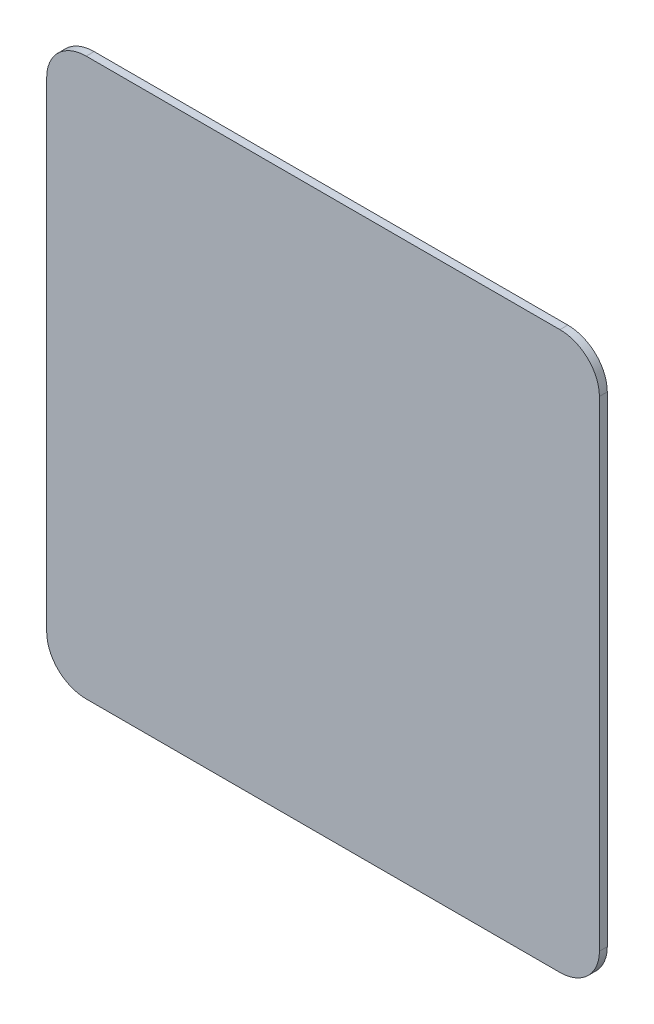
ISO-10303-21;
HEADER;
FILE_DESCRIPTION(('STEP AP214'),'2;1');
FILE_NAME('part.step','',(''),(''),'','','');
FILE_SCHEMA(('AUTOMOTIVE_DESIGN { 1 0 10303 214 1 1 1 1 }'));
ENDSEC;
DATA;
#1=APPLICATION_CONTEXT('core data for automotive mechanical design processes');
#2=APPLICATION_PROTOCOL_DEFINITION('international standard','automotive_design',2000,#1);
#3=PRODUCT_CONTEXT('',#1,'mechanical');
#4=PRODUCT('Part','Part','',(#3));
#5=PRODUCT_RELATED_PRODUCT_CATEGORY('part','',(#4));
#6=PRODUCT_DEFINITION_FORMATION('','',#4);
#7=PRODUCT_DEFINITION_CONTEXT('part definition',#1,'design');
#8=PRODUCT_DEFINITION('design','',#6,#7);
#9=PRODUCT_DEFINITION_SHAPE('','',#8);
#10=(LENGTH_UNIT() NAMED_UNIT(*) SI_UNIT(.MILLI.,.METRE.));
#11=(NAMED_UNIT(*) PLANE_ANGLE_UNIT() SI_UNIT($,.RADIAN.));
#12=(NAMED_UNIT(*) SI_UNIT($,.STERADIAN.) SOLID_ANGLE_UNIT());
#13=UNCERTAINTY_MEASURE_WITH_UNIT(LENGTH_MEASURE(1.E-05),#10,'distance_accuracy_value','');
#14=(GEOMETRIC_REPRESENTATION_CONTEXT(3) GLOBAL_UNCERTAINTY_ASSIGNED_CONTEXT((#13)) GLOBAL_UNIT_ASSIGNED_CONTEXT((#10,
#11,#12)) REPRESENTATION_CONTEXT('',''));
#15=CARTESIAN_POINT('',(0.,0.,0.));
#16=DIRECTION('',(0.,0.,1.));
#17=DIRECTION('',(1.,0.,0.));
#18=AXIS2_PLACEMENT_3D('',#15,#16,#17);
#19=CARTESIAN_POINT('',(300.,321.343713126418,-10.));
#20=DIRECTION('',(0.,0.,1.));
#21=DIRECTION('',(1.,0.,0.));
#22=AXIS2_PLACEMENT_3D('',#19,#20,#21);
#23=ELLIPSE('',#22,50.,48.2962913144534);
#24=DIRECTION('',(0.,0.,1.));
#25=VECTOR('',#24,1.);
#26=SURFACE_OF_LINEAR_EXTRUSION('',#23,#25);
#27=CARTESIAN_POINT('',(300.,321.343713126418,0.));
#28=DIRECTION('',(0.,0.,1.));
#29=DIRECTION('',(1.,0.,0.));
#30=AXIS2_PLACEMENT_3D('',#27,#28,#29);
#31=ELLIPSE('',#30,50.,48.2962913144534);
#32=CARTESIAN_POINT('',(350.,321.343713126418,0.));
#33=VERTEX_POINT('',#32);
#34=CARTESIAN_POINT('',(300.,369.640004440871,0.));
#35=VERTEX_POINT('',#34);
#36=EDGE_CURVE('E192',#33,#35,#31,.T.);
#37=ORIENTED_EDGE('',*,*,#36,.F.);
#38=DIRECTION('',(0.,0.,1.));
#39=VECTOR('',#38,1.);
#40=CARTESIAN_POINT('',(350.,321.343713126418,-10.));
#41=LINE('',#40,#39);
#42=CARTESIAN_POINT('',(350.,321.343713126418,-10.));
#43=VERTEX_POINT('',#42);
#44=EDGE_CURVE('E11',#43,#33,#41,.T.);
#45=ORIENTED_EDGE('',*,*,#44,.F.);
#46=CARTESIAN_POINT('',(300.,369.640004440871,-10.));
#47=VERTEX_POINT('',#46);
#48=EDGE_CURVE('E180',#43,#47,#23,.T.);
#49=ORIENTED_EDGE('',*,*,#48,.T.);
#50=DIRECTION('',(0.,0.,1.));
#51=VECTOR('',#50,1.);
#52=CARTESIAN_POINT('',(300.,369.640004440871,-10.));
#53=LINE('',#52,#51);
#54=EDGE_CURVE('E38',#47,#35,#53,.T.);
#55=ORIENTED_EDGE('',*,*,#54,.T.);
#56=EDGE_LOOP('',(#37,#45,#49,#55));
#57=FACE_BOUND('',#56,.T.);
#58=ADVANCED_FACE('F34',(#57),#26,.T.);
#59=CARTESIAN_POINT('',(350.,-287.189557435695,-10.));
#60=DIRECTION('',(1.,0.,0.));
#61=DIRECTION('',(0.,0.,-1.));
#62=AXIS2_PLACEMENT_3D('',#59,#60,#61);
#63=PLANE('',#62);
#64=DIRECTION('',(0.,1.,0.));
#65=VECTOR('',#64,1.);
#66=CARTESIAN_POINT('',(350.,-287.189557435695,0.));
#67=LINE('',#66,#65);
#68=CARTESIAN_POINT('',(350.,-287.189557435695,0.));
#69=VERTEX_POINT('',#68);
#70=EDGE_CURVE('E177',#69,#33,#67,.T.);
#71=ORIENTED_EDGE('',*,*,#70,.F.);
#72=DIRECTION('',(0.,0.,1.));
#73=VECTOR('',#72,1.);
#74=CARTESIAN_POINT('',(350.,-287.189557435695,-10.));
#75=LINE('',#74,#73);
#76=CARTESIAN_POINT('',(350.,-287.189557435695,-10.));
#77=VERTEX_POINT('',#76);
#78=EDGE_CURVE('E44',#77,#69,#75,.T.);
#79=ORIENTED_EDGE('',*,*,#78,.F.);
#80=DIRECTION('',(0.,1.,0.));
#81=VECTOR('',#80,1.);
#82=CARTESIAN_POINT('',(350.,-287.189557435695,-10.));
#83=LINE('',#82,#81);
#84=EDGE_CURVE('E122',#77,#43,#83,.T.);
#85=ORIENTED_EDGE('',*,*,#84,.T.);
#86=ORIENTED_EDGE('',*,*,#44,.T.);
#87=EDGE_LOOP('',(#71,#79,#85,#86));
#88=FACE_BOUND('',#87,.T.);
#89=ADVANCED_FACE('F138',(#88),#63,.T.);
#90=CARTESIAN_POINT('',(300.,-287.189557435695,-10.));
#91=DIRECTION('',(0.,0.,1.));
#92=DIRECTION('',(1.,0.,0.));
#93=AXIS2_PLACEMENT_3D('',#90,#91,#92);
#94=ELLIPSE('',#93,50.,48.2962913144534);
#95=DIRECTION('',(0.,0.,1.));
#96=VECTOR('',#95,1.);
#97=SURFACE_OF_LINEAR_EXTRUSION('',#94,#96);
#98=CARTESIAN_POINT('',(300.,-287.189557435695,0.));
#99=DIRECTION('',(0.,0.,1.));
#100=DIRECTION('',(1.,0.,0.));
#101=AXIS2_PLACEMENT_3D('',#98,#99,#100);
#102=ELLIPSE('',#101,50.,48.2962913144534);
#103=CARTESIAN_POINT('',(300.,-335.485848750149,0.));
#104=VERTEX_POINT('',#103);
#105=EDGE_CURVE('E109',#104,#69,#102,.T.);
#106=ORIENTED_EDGE('',*,*,#105,.F.);
#107=DIRECTION('',(0.,0.,1.));
#108=VECTOR('',#107,1.);
#109=CARTESIAN_POINT('',(300.,-335.485848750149,-10.));
#110=LINE('',#109,#108);
#111=CARTESIAN_POINT('',(300.,-335.485848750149,-10.));
#112=VERTEX_POINT('',#111);
#113=EDGE_CURVE('E104',#112,#104,#110,.T.);
#114=ORIENTED_EDGE('',*,*,#113,.F.);
#115=EDGE_CURVE('E107',#112,#77,#94,.T.);
#116=ORIENTED_EDGE('',*,*,#115,.T.);
#117=ORIENTED_EDGE('',*,*,#78,.T.);
#118=EDGE_LOOP('',(#106,#114,#116,#117));
#119=FACE_BOUND('',#118,.T.);
#120=ADVANCED_FACE('F106',(#119),#97,.T.);
#121=CARTESIAN_POINT('',(-300.,-335.485848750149,-10.));
#122=DIRECTION('',(0.,-1.,0.));
#123=DIRECTION('',(1.,0.,0.));
#124=AXIS2_PLACEMENT_3D('',#121,#122,#123);
#125=PLANE('',#124);
#126=DIRECTION('',(1.,0.,0.));
#127=VECTOR('',#126,1.);
#128=CARTESIAN_POINT('',(-300.,-335.485848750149,0.));
#129=LINE('',#128,#127);
#130=CARTESIAN_POINT('',(-300.,-335.485848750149,0.));
#131=VERTEX_POINT('',#130);
#132=EDGE_CURVE('E182',#131,#104,#129,.T.);
#133=ORIENTED_EDGE('',*,*,#132,.F.);
#134=DIRECTION('',(0.,0.,1.));
#135=VECTOR('',#134,1.);
#136=CARTESIAN_POINT('',(-300.,-335.485848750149,-10.));
#137=LINE('',#136,#135);
#138=CARTESIAN_POINT('',(-300.,-335.485848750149,-10.));
#139=VERTEX_POINT('',#138);
#140=EDGE_CURVE('E114',#139,#131,#137,.T.);
#141=ORIENTED_EDGE('',*,*,#140,.F.);
#142=DIRECTION('',(1.,0.,0.));
#143=VECTOR('',#142,1.);
#144=CARTESIAN_POINT('',(-300.,-335.485848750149,-10.));
#145=LINE('',#144,#143);
#146=EDGE_CURVE('E120',#139,#112,#145,.T.);
#147=ORIENTED_EDGE('',*,*,#146,.T.);
#148=ORIENTED_EDGE('',*,*,#113,.T.);
#149=EDGE_LOOP('',(#133,#141,#147,#148));
#150=FACE_BOUND('',#149,.T.);
#151=ADVANCED_FACE('F124',(#150),#125,.T.);
#152=CARTESIAN_POINT('',(-300.,-287.189557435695,-10.));
#153=DIRECTION('',(0.,0.,1.));
#154=DIRECTION('',(1.,0.,0.));
#155=AXIS2_PLACEMENT_3D('',#152,#153,#154);
#156=ELLIPSE('',#155,50.,48.2962913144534);
#157=DIRECTION('',(0.,0.,1.));
#158=VECTOR('',#157,1.);
#159=SURFACE_OF_LINEAR_EXTRUSION('',#156,#158);
#160=CARTESIAN_POINT('',(-300.,-287.189557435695,0.));
#161=DIRECTION('',(0.,0.,1.));
#162=DIRECTION('',(1.,0.,0.));
#163=AXIS2_PLACEMENT_3D('',#160,#161,#162);
#164=ELLIPSE('',#163,50.,48.2962913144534);
#165=CARTESIAN_POINT('',(-350.,-287.189557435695,0.));
#166=VERTEX_POINT('',#165);
#167=EDGE_CURVE('E184',#166,#131,#164,.T.);
#168=ORIENTED_EDGE('',*,*,#167,.F.);
#169=DIRECTION('',(0.,0.,1.));
#170=VECTOR('',#169,1.);
#171=CARTESIAN_POINT('',(-350.,-287.189557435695,-10.));
#172=LINE('',#171,#170);
#173=CARTESIAN_POINT('',(-350.,-287.189557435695,-10.));
#174=VERTEX_POINT('',#173);
#175=EDGE_CURVE('E163',#174,#166,#172,.T.);
#176=ORIENTED_EDGE('',*,*,#175,.F.);
#177=EDGE_CURVE('E125',#174,#139,#156,.T.);
#178=ORIENTED_EDGE('',*,*,#177,.T.);
#179=ORIENTED_EDGE('',*,*,#140,.T.);
#180=EDGE_LOOP('',(#168,#176,#178,#179));
#181=FACE_BOUND('',#180,.T.);
#182=ADVANCED_FACE('F142',(#181),#159,.T.);
#183=CARTESIAN_POINT('',(-350.,321.343713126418,-10.));
#184=DIRECTION('',(-1.,0.,0.));
#185=DIRECTION('',(0.,0.,1.));
#186=AXIS2_PLACEMENT_3D('',#183,#184,#185);
#187=PLANE('',#186);
#188=DIRECTION('',(0.,-1.,0.));
#189=VECTOR('',#188,1.);
#190=CARTESIAN_POINT('',(-350.,321.343713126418,0.));
#191=LINE('',#190,#189);
#192=CARTESIAN_POINT('',(-350.,321.343713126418,0.));
#193=VERTEX_POINT('',#192);
#194=EDGE_CURVE('E187',#193,#166,#191,.T.);
#195=ORIENTED_EDGE('',*,*,#194,.F.);
#196=DIRECTION('',(0.,0.,1.));
#197=VECTOR('',#196,1.);
#198=CARTESIAN_POINT('',(-350.,321.343713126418,-10.));
#199=LINE('',#198,#197);
#200=CARTESIAN_POINT('',(-350.,321.343713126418,-10.));
#201=VERTEX_POINT('',#200);
#202=EDGE_CURVE('E165',#201,#193,#199,.T.);
#203=ORIENTED_EDGE('',*,*,#202,.F.);
#204=DIRECTION('',(0.,-1.,0.));
#205=VECTOR('',#204,1.);
#206=CARTESIAN_POINT('',(-350.,321.343713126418,-10.));
#207=LINE('',#206,#205);
#208=EDGE_CURVE('E127',#201,#174,#207,.T.);
#209=ORIENTED_EDGE('',*,*,#208,.T.);
#210=ORIENTED_EDGE('',*,*,#175,.T.);
#211=EDGE_LOOP('',(#195,#203,#209,#210));
#212=FACE_BOUND('',#211,.T.);
#213=ADVANCED_FACE('F145',(#212),#187,.T.);
#214=CARTESIAN_POINT('',(-300.,321.343713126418,-10.));
#215=DIRECTION('',(0.,0.,1.));
#216=DIRECTION('',(1.,0.,0.));
#217=AXIS2_PLACEMENT_3D('',#214,#215,#216);
#218=ELLIPSE('',#217,50.,48.2962913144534);
#219=DIRECTION('',(0.,0.,1.));
#220=VECTOR('',#219,1.);
#221=SURFACE_OF_LINEAR_EXTRUSION('',#218,#220);
#222=CARTESIAN_POINT('',(-300.,321.343713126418,0.));
#223=DIRECTION('',(0.,0.,1.));
#224=DIRECTION('',(1.,0.,0.));
#225=AXIS2_PLACEMENT_3D('',#222,#223,#224);
#226=ELLIPSE('',#225,50.,48.2962913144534);
#227=CARTESIAN_POINT('',(-300.,369.640004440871,0.));
#228=VERTEX_POINT('',#227);
#229=EDGE_CURVE('E170',#228,#193,#226,.T.);
#230=ORIENTED_EDGE('',*,*,#229,.F.);
#231=DIRECTION('',(0.,0.,1.));
#232=VECTOR('',#231,1.);
#233=CARTESIAN_POINT('',(-300.,369.640004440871,-10.));
#234=LINE('',#233,#232);
#235=CARTESIAN_POINT('',(-300.,369.640004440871,-10.));
#236=VERTEX_POINT('',#235);
#237=EDGE_CURVE('E168',#236,#228,#234,.T.);
#238=ORIENTED_EDGE('',*,*,#237,.F.);
#239=EDGE_CURVE('E155',#236,#201,#218,.T.);
#240=ORIENTED_EDGE('',*,*,#239,.T.);
#241=ORIENTED_EDGE('',*,*,#202,.T.);
#242=EDGE_LOOP('',(#230,#238,#240,#241));
#243=FACE_BOUND('',#242,.T.);
#244=ADVANCED_FACE('F149',(#243),#221,.T.);
#245=CARTESIAN_POINT('',(300.,369.640004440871,-10.));
#246=DIRECTION('',(0.,1.,0.));
#247=DIRECTION('',(-1.,0.,0.));
#248=AXIS2_PLACEMENT_3D('',#245,#246,#247);
#249=PLANE('',#248);
#250=DIRECTION('',(-1.,0.,0.));
#251=VECTOR('',#250,1.);
#252=CARTESIAN_POINT('',(300.,369.640004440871,0.));
#253=LINE('',#252,#251);
#254=EDGE_CURVE('E191',#35,#228,#253,.T.);
#255=ORIENTED_EDGE('',*,*,#254,.F.);
#256=ORIENTED_EDGE('',*,*,#54,.F.);
#257=DIRECTION('',(-1.,0.,0.));
#258=VECTOR('',#257,1.);
#259=CARTESIAN_POINT('',(300.,369.640004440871,-10.));
#260=LINE('',#259,#258);
#261=EDGE_CURVE('E159',#47,#236,#260,.T.);
#262=ORIENTED_EDGE('',*,*,#261,.T.);
#263=ORIENTED_EDGE('',*,*,#237,.T.);
#264=EDGE_LOOP('',(#255,#256,#262,#263));
#265=FACE_BOUND('',#264,.T.);
#266=ADVANCED_FACE('F153',(#265),#249,.T.);
#267=CARTESIAN_POINT('',(300.,321.343713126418,-10.));
#268=DIRECTION('',(0.,0.,1.));
#269=DIRECTION('',(1.,0.,0.));
#270=AXIS2_PLACEMENT_3D('',#267,#268,#269);
#271=PLANE('',#270);
#272=ORIENTED_EDGE('',*,*,#48,.F.);
#273=ORIENTED_EDGE('',*,*,#84,.F.);
#274=ORIENTED_EDGE('',*,*,#115,.F.);
#275=ORIENTED_EDGE('',*,*,#146,.F.);
#276=ORIENTED_EDGE('',*,*,#177,.F.);
#277=ORIENTED_EDGE('',*,*,#208,.F.);
#278=ORIENTED_EDGE('',*,*,#239,.F.);
#279=ORIENTED_EDGE('',*,*,#261,.F.);
#280=EDGE_LOOP('',(#272,#273,#274,#275,#276,#277,#278,#279));
#281=FACE_BOUND('',#280,.T.);
#282=ADVANCED_FACE('F118',(#281),#271,.F.);
#283=CARTESIAN_POINT('',(300.,321.343713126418,0.));
#284=DIRECTION('',(0.,0.,1.));
#285=DIRECTION('',(1.,0.,0.));
#286=AXIS2_PLACEMENT_3D('',#283,#284,#285);
#287=PLANE('',#286);
#288=ORIENTED_EDGE('',*,*,#36,.T.);
#289=ORIENTED_EDGE('',*,*,#254,.T.);
#290=ORIENTED_EDGE('',*,*,#229,.T.);
#291=ORIENTED_EDGE('',*,*,#194,.T.);
#292=ORIENTED_EDGE('',*,*,#167,.T.);
#293=ORIENTED_EDGE('',*,*,#132,.T.);
#294=ORIENTED_EDGE('',*,*,#105,.T.);
#295=ORIENTED_EDGE('',*,*,#70,.T.);
#296=EDGE_LOOP('',(#288,#289,#290,#291,#292,#293,#294,#295));
#297=FACE_BOUND('',#296,.T.);
#298=ADVANCED_FACE('F195',(#297),#287,.T.);
#299=CLOSED_SHELL('',(#58,#89,#120,#151,#182,#213,#244,#266,#282,#298));
#300=MANIFOLD_SOLID_BREP('B2',#299);
#301=ADVANCED_BREP_SHAPE_REPRESENTATION('',(#18,#300),#14);
#302=SHAPE_DEFINITION_REPRESENTATION(#9,#301);
ENDSEC;
END-ISO-10303-21;
